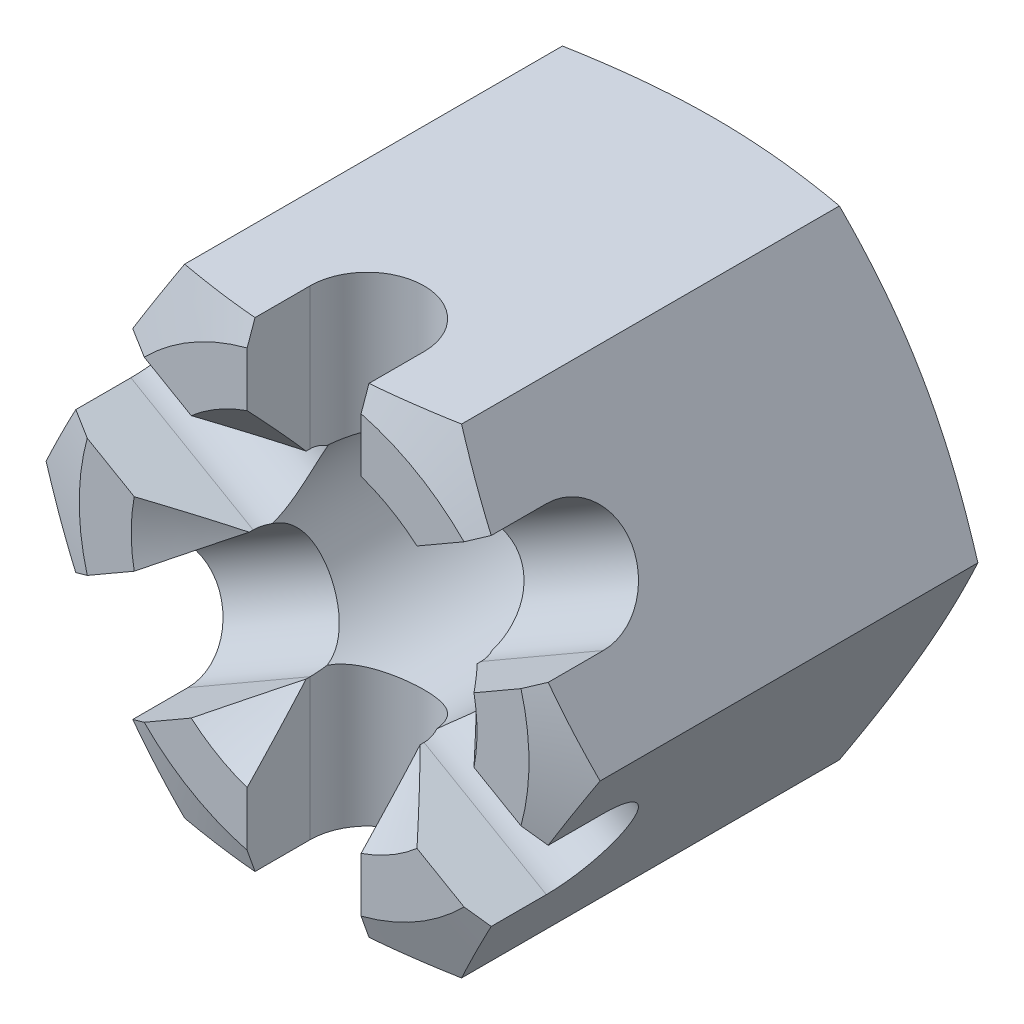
from build123d import *

# Parameters (mm, degrees)
BASENUT_DEPTH     = 20.8
SKETCH3_R         = 5.5
HOLE_DEPTH        = 31.118592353
SLOT_DEPTH        = 39.248765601
SLOTPATTERN_COUNT = 6


with BuildPart() as part:
    # Sketch1 → BaseNut (new body)
    with BuildSketch(Plane.XY):
        Polygon((6.92820323, -12), (13.856406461, 0), (6.92820323, 12), (-6.92820323, 12), (-13.856406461, 0), (-6.92820323, -12), align=None)
    extrude(amount=-BASENUT_DEPTH)

    # Sketch2 → Double-Chamfer (revolve, cut)
    with BuildSketch(Plane(origin=(-3.47179677, 0, -17.32820323), x_dir=(0, 0, -1), z_dir=(0, 1, 0))):
        Polygon((3.47179677, 7.77820323), (2.5231424, 10.384609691), (3.47179677, 10.384609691), align=None)
        Polygon((-17.32820323, 7.77820323), (-17.32820323, 10.384609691), (-16.37954886, 10.384609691), align=None)
    revolve(axis=Axis((0, 0, -17.32820323), (0, 0, 1)), mode=Mode.SUBTRACT)

    # Sketch3 → Hole (cut, through all)
    with BuildSketch(Plane(origin=(2.620769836, -2.247535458, -20.8), x_dir=(-1, 0, 0), z_dir=(0, 0, -1))):
        with Locations((2.620769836, 2.247535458)):
            Circle(SKETCH3_R)
    extrude(amount=-HOLE_DEPTH, mode=Mode.SUBTRACT)

    # Sketch4 → EndChamfer (revolve, cut)
    with BuildSketch(Plane(origin=(-15.758283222, 0, -7.108283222), x_dir=(0, 0, -1), z_dir=(0, 1, 0)), mode=Mode.PRIVATE) as endchamfer_sk:
        Polygon((13.691716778, -24.408283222), (10.541716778, -21.258283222), (13.691716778, -21.258283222), align=None)
        Polygon((-7.108283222, -21.258283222), (-3.958283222, -21.258283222), (-7.108283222, -24.408283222), align=None)
    revolve(endchamfer_sk.sketch.rotate(Axis((0, 0, -7.108283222), (0, 0, 1)), 180), axis=Axis((0, 0, -7.108283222), (0, 0, 1)), mode=Mode.SUBTRACT)

    # Sketch5 → Slot (cut, through all)
    with BuildSketch(Plane(origin=(-17.8, 0, -17.8), x_dir=(0, 0, -1), z_dir=(0, 1, 0))):
        with BuildLine():
            Line((-17.8, -14.95), (-14.65, -14.95))
            ThreePointArc((-14.65, -14.95), (-11.8, -17.8), (-14.65, -20.65))
            Line((-14.65, -20.65), (-17.8, -20.65))
            Line((-17.8, -20.65), (-17.8, -14.95))
        make_face()
    slot = extrude(amount=-SLOT_DEPTH, mode=Mode.SUBTRACT)

    # SlotPattern: Slot ×6 about axis
    slotpattern_axis = Axis((0, 0, 0), (0, 0, 1))
    for i in range(1, SLOTPATTERN_COUNT):
        add(slot.rotate(slotpattern_axis, i * 360 / SLOTPATTERN_COUNT), mode=Mode.SUBTRACT)


solid = part.part
